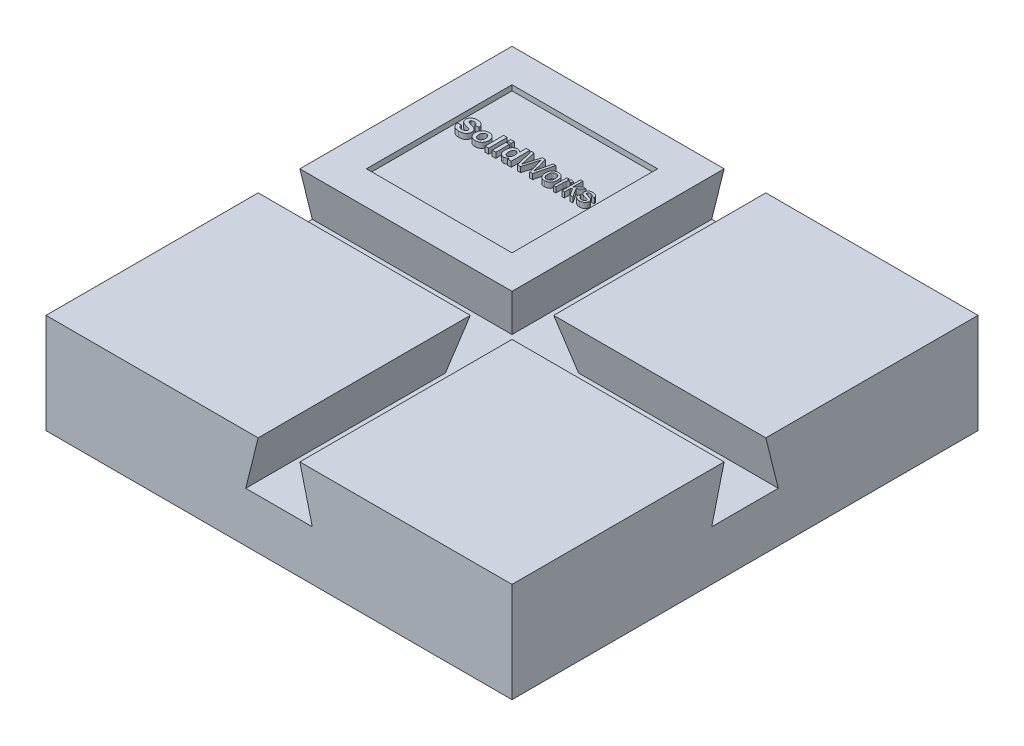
from build123d import *

# Parameters (mm, degrees)
SKETCH1_W           = 88.9
SKETCH1_H           = 88.9
BASE_EXTRUDE_DEPTH  = 19.05
CUT_EXTRUDE1_DEPTH  = 102.202346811
CUT_EXTRUDE2_DEPTH  = 103.21917076
SKETCH4_W           = 27.774849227
SKETCH4_H           = 27.774849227
CUT_EXTRUDE3_DEPTH  = 1.016
SKETCH5_W           = 0.679850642
SKETCH5_H           = 3.535223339
SKETCH5_H_2         = 0.58920389
SKETCH5_H_3         = 2.58343244
BOSS_EXTRUDE1_DEPTH = 1.016
BOSS_EXTRUDE2_DEPTH = 1.016


with BuildPart() as part:
    # Sketch1 → Base-Extrude (new body)
    with BuildSketch(Plane(origin=(0, 0, 0), x_dir=(1, 0, 0), z_dir=(0, 1, 0))):
        Rectangle(SKETCH1_W, SKETCH1_H)
    extrude(amount=BASE_EXTRUDE_DEPTH)

    # Sketch2 → Cut-Extrude1 (cut, through all)
    with BuildSketch(Plane.XY.offset(44.45)):
        Polygon((6.35, 9.525), (-6.35, 9.525), (-3.975150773, 19.05), (3.975150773, 19.05), align=None)
    extrude(amount=-CUT_EXTRUDE1_DEPTH, mode=Mode.SUBTRACT)

    # Sketch3 → Cut-Extrude2 (cut, through all)
    with BuildSketch(Plane(origin=(44.45, -3.538159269, -0.664564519), x_dir=(0, 0, -1), z_dir=(1, 0, 0))):
        Polygon((5.685435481, 13.063159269), (-7.014564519, 13.063159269), (-4.639715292, 22.588159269), (3.310586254, 22.588159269), align=None)
    extrude(amount=-CUT_EXTRUDE2_DEPTH, mode=Mode.SUBTRACT)

    # Sketch4 → Cut-Extrude3 (cut)
    with BuildSketch(Plane(origin=(0, 19.05, 0), x_dir=(-1, 0, 0), z_dir=(0, 1, 0))):
        with Locations((24.212575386, -24.212575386)):
            Rectangle(SKETCH4_W, SKETCH4_H)
    extrude(amount=-CUT_EXTRUDE3_DEPTH, mode=Mode.SUBTRACT)

    # Sketch5 → Boss-Extrude1 (add)
    # profile 1 of 6: a face of its own
    with BuildSketch(Plane(origin=(20.693749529, 18.034, -39.225659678), x_dir=(1, 0, 0), z_dir=(0, 1, 0))):
        with BuildLine():
            Line((-57.661495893, -12.647251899), (-56.981645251, -12.601928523))
            add(Edge.make_bspline(
                [(-56.981645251, -12.601928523), (-56.976229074, -12.630371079), (-56.965708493, -12.685618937), (-56.942333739, -12.764354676), (-56.916604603, -12.837758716), (-56.885856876, -12.905043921), (-56.852195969, -12.967454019), (-56.812856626, -13.023211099), (-56.770583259, -13.074095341), (-56.723283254, -13.1182792), (-56.671750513, -13.156976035), (-56.615727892, -13.189977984), (-56.555822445, -13.218541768), (-56.491887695, -13.242063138), (-56.423264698, -13.259621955), (-56.350551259, -13.272114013), (-56.273643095, -13.280113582), (-56.22108249, -13.281214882), (-56.194151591, -13.281779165)],
                knots=[0, 0, 0, 0, 1.204560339, 2.339781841, 3.415289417, 4.440034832, 5.416475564, 6.362424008, 7.275913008, 8.16578645, 9.05021719, 9.95355393, 10.867835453, 11.809845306, 12.784702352, 13.812224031, 14.87903166, 16, 16, 16, 16], degree=3))
            add(Edge.make_bspline(
                [(-56.194151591, -13.281779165), (-56.165805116, -13.281469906), (-56.110669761, -13.280868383), (-56.030772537, -13.273405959), (-55.956065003, -13.262715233), (-55.887206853, -13.245792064), (-55.822912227, -13.226866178), (-55.764777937, -13.20097355), (-55.71186323, -13.171110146), (-55.664304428, -13.13722292), (-55.622799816, -13.099639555), (-55.586489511, -13.060403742), (-55.554865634, -13.020363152), (-55.529975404, -12.977740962), (-55.509832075, -12.934260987), (-55.496518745, -12.888626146), (-55.487524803, -12.841884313), (-55.48649346, -12.809939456), (-55.485973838, -12.793844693)],
                knots=[0, 0, 0, 0, 1.417779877, 2.757654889, 4.012140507, 5.189587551, 6.302846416, 7.360586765, 8.365575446, 9.33904572, 10.275781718, 11.161696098, 12.012180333, 12.822428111, 13.625933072, 14.403138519, 15.195454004, 16, 16, 16, 16], degree=3))
            add(Edge.make_bspline(
                [(-55.485973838, -12.793844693), (-55.48661111, -12.773679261), (-55.487857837, -12.734228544), (-55.502867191, -12.677829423), (-55.525376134, -12.625577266), (-55.559266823, -12.578243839), (-55.604824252, -12.534987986), (-55.662937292, -12.494523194), (-55.735228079, -12.458120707), (-55.788858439, -12.437815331), (-55.817401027, -12.427008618)],
                knots=[0, 0, 0, 0, 0.90494901, 1.770400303, 2.607161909, 3.452839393, 4.36912122, 5.420987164, 6.627424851, 8, 8, 8, 8], degree=3))
            add(Edge.make_bspline(
                [(-55.817401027, -12.427008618), (-55.829647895, -12.422904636), (-55.857054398, -12.41372059), (-55.903806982, -12.400588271), (-55.960121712, -12.384189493), (-56.02681237, -12.365549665), (-56.103856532, -12.346486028), (-56.190393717, -12.323001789), (-56.287478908, -12.299633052), (-56.355399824, -12.282382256), (-56.391025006, -12.273334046)],
                knots=[0, 0, 0, 0, 0.521821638, 1.167752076, 1.961721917, 2.891982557, 3.96540661, 5.168436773, 6.514817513, 8, 8, 8, 8], degree=3))
            add(Edge.make_bspline(
                [(-56.391025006, -12.273334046), (-56.437419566, -12.261750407), (-56.526930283, -12.239401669), (-56.654593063, -12.19964485), (-56.772172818, -12.160144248), (-56.878537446, -12.117283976), (-56.974860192, -12.073968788), (-57.059583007, -12.027157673), (-57.134473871, -11.979281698), (-57.178114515, -11.943498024), (-57.199055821, -11.926326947)],
                knots=[0, 0, 0, 0, 1.293880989, 2.496331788, 3.617634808, 4.64976062, 5.598842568, 6.473791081, 7.267636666, 8, 8, 8, 8], degree=3))
            add(Edge.make_bspline(
                [(-57.199055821, -11.926326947), (-57.225025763, -11.902011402), (-57.275942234, -11.854338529), (-57.342965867, -11.776002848), (-57.399283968, -11.693253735), (-57.445639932, -11.606701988), (-57.481333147, -11.515849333), (-57.506632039, -11.4213039), (-57.5230064, -11.322818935), (-57.524677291, -11.25574834), (-57.525525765, -11.221690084)],
                knots=[0, 0, 0, 0, 1.064429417, 2.086912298, 3.078678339, 4.055528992, 5.020032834, 5.993708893, 6.981211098, 8, 8, 8, 8], degree=3))
            add(Edge.make_bspline(
                [(-57.525525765, -11.221690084), (-57.523873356, -11.177619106), (-57.520595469, -11.090195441), (-57.490535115, -10.961694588), (-57.443709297, -10.837701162), (-57.389402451, -10.73924579), (-57.337225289, -10.664763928), (-57.293895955, -10.611316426), (-57.246294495, -10.561294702), (-57.19376887, -10.515918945), (-57.138269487, -10.472531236), (-57.077646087, -10.434002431), (-57.013617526, -10.397710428), (-56.920960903, -10.354687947), (-56.795158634, -10.309854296), (-56.631483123, -10.272062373), (-56.453272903, -10.249344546), (-56.329719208, -10.246557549), (-56.265677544, -10.245112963)],
                knots=[0, 0, 0, 0, 1.180131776, 2.341029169, 3.518901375, 4.725685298, 5.343762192, 5.955650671, 6.568945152, 7.192346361, 7.815201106, 8.455999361, 9.116257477, 9.787318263, 11.192748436, 12.688084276, 14.283332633, 16, 16, 16, 16], degree=3))
            add(Edge.make_bspline(
                [(-56.265677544, -10.245112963), (-56.213240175, -10.245814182), (-56.111250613, -10.247178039), (-55.963404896, -10.260969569), (-55.825308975, -10.282434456), (-55.697447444, -10.3132472), (-55.57976073, -10.353958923), (-55.471792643, -10.402454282), (-55.37363493, -10.460030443), (-55.286482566, -10.527017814), (-55.208838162, -10.600867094), (-55.141105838, -10.681531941), (-55.083026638, -10.767993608), (-55.034225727, -10.860188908), (-54.9959025, -10.958591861), (-54.967755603, -11.063079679), (-54.949139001, -11.173406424), (-54.944472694, -11.249003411), (-54.942093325, -11.287550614)],
                knots=[0, 0, 0, 0, 1.325124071, 2.577337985, 3.749592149, 4.855247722, 5.896868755, 6.892903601, 7.842551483, 8.766257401, 9.665194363, 10.546067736, 11.423174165, 12.293291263, 13.177512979, 14.086532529, 15.024315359, 16, 16, 16, 16], degree=3))
            Line((-54.942093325, -11.287550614), (-55.621943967, -11.332873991))
            add(Edge.make_bspline(
                [(-55.621943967, -11.332873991), (-55.625865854, -11.311555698), (-55.633509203, -11.270008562), (-55.650127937, -11.210504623), (-55.668873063, -11.155470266), (-55.690813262, -11.104905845), (-55.717314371, -11.059717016), (-55.746155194, -11.018482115), (-55.778131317, -10.981750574), (-55.814301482, -10.95052822), (-55.853422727, -10.922117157), (-55.898007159, -10.899345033), (-55.946186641, -10.878217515), (-55.99979411, -10.862334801), (-56.057800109, -10.849736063), (-56.120238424, -10.840396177), (-56.187238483, -10.835835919), (-56.233332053, -10.8348348), (-56.257179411, -10.834316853)],
                knots=[0, 0, 0, 0, 1.151066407, 2.24330871, 3.278475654, 4.238599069, 5.165719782, 6.056502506, 6.909492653, 7.744782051, 8.590364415, 9.471203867, 10.39832458, 11.382154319, 12.435022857, 13.550631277, 14.73277401, 16, 16, 16, 16], degree=3))
            add(Edge.make_bspline(
                [(-56.257179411, -10.834316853), (-56.28197415, -10.834774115), (-56.330213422, -10.835663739), (-56.400510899, -10.84112323), (-56.466455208, -10.851200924), (-56.528370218, -10.864319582), (-56.586173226, -10.882166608), (-56.639742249, -10.903928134), (-56.689322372, -10.929548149), (-56.719554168, -10.949705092), (-56.734491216, -10.959664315)],
                knots=[0, 0, 0, 0, 1.186678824, 2.308736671, 3.37120409, 4.377216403, 5.334874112, 6.262130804, 7.141346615, 8, 8, 8, 8], degree=3))
            add(Edge.make_bspline(
                [(-56.734491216, -10.959664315), (-56.751585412, -10.973268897), (-56.784691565, -10.99961675), (-56.820320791, -11.051934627), (-56.841769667, -11.1110261), (-56.844351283, -11.152813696), (-56.845675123, -11.174242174)],
                knots=[0, 0, 0, 0, 1.037857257, 2.010007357, 2.979541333, 4, 4, 4, 4], degree=3))
            add(Edge.make_bspline(
                [(-56.845675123, -11.174242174), (-56.844592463, -11.19426851), (-56.842459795, -11.233717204), (-56.820949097, -11.289754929), (-56.787868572, -11.341677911), (-56.756960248, -11.369883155), (-56.740864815, -11.384570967)],
                knots=[0, 0, 0, 0, 0.98538058, 1.941042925, 2.927803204, 4, 4, 4, 4], degree=3))
            add(Edge.make_bspline(
                [(-56.740864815, -11.384570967), (-56.728091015, -11.394104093), (-56.699546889, -11.415406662), (-56.647259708, -11.442484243), (-56.584147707, -11.471810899), (-56.508772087, -11.500480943), (-56.421633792, -11.529097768), (-56.322727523, -11.558977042), (-56.211992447, -11.589257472), (-56.092251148, -11.618582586), (-55.970680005, -11.647407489), (-55.854668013, -11.678921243), (-55.746793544, -11.709644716), (-55.64755678, -11.741847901), (-55.556446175, -11.773197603), (-55.473904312, -11.805396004), (-55.399364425, -11.836753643), (-55.312442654, -11.879872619), (-55.213925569, -11.938279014), (-55.110668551, -12.023182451), (-55.019350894, -12.118619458), (-54.955723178, -12.208609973), (-54.912014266, -12.28600421), (-54.883870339, -12.347696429), (-54.859523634, -12.412704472), (-54.839705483, -12.481100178), (-54.825342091, -12.552979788), (-54.813455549, -12.627794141), (-54.807382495, -12.706164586), (-54.80654748, -12.759607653), (-54.806123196, -12.786762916)],
                knots=[0, 0, 0, 0, 0.511875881, 1.143829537, 1.88775736, 2.750598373, 3.734912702, 4.837306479, 6.073130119, 7.42648979, 8.801963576, 10.091065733, 11.292408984, 12.408830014, 13.446061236, 14.39066453, 15.257936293, 16.045629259, 17.510392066, 18.929669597, 20.331293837, 21.746891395, 22.460690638, 23.187651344, 23.925159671, 24.69163991, 25.474819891, 26.281170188, 27.126635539, 28, 28, 28, 28], degree=3))
            add(Edge.make_bspline(
                [(-54.806123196, -12.786762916), (-54.8067066, -12.811806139), (-54.807865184, -12.861539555), (-54.815961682, -12.9353565), (-54.828482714, -13.007862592), (-54.847018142, -13.079148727), (-54.871607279, -13.14907467), (-54.899292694, -13.218649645), (-54.933911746, -13.286356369), (-54.973312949, -13.35225092), (-55.016774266, -13.416283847), (-55.066024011, -13.475352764), (-55.118169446, -13.531428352), (-55.176542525, -13.581370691), (-55.237538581, -13.62922364), (-55.303947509, -13.671603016), (-55.374213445, -13.709952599), (-55.448780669, -13.74398607), (-55.527913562, -13.773643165), (-55.611509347, -13.800040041), (-55.700321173, -13.821643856), (-55.793608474, -13.840161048), (-55.891712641, -13.854242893), (-55.994511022, -13.864075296), (-56.102026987, -13.869620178), (-56.175260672, -13.870523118), (-56.212564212, -13.870983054)],
                knots=[0, 0, 0, 0, 0.900570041, 1.788444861, 2.667795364, 3.545012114, 4.433698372, 5.332345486, 6.235991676, 7.164928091, 8.092777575, 9.015680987, 9.928493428, 10.842962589, 11.775229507, 12.714851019, 13.672254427, 14.652424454, 15.660007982, 16.709910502, 17.803296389, 18.945495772, 20.129342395, 21.366102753, 22.658353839, 24, 24, 24, 24], degree=3))
            add(Edge.make_bspline(
                [(-56.212564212, -13.870983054), (-56.266424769, -13.870103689), (-56.371292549, -13.868391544), (-56.5236466, -13.853066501), (-56.666544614, -13.829610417), (-56.799753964, -13.795567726), (-56.923437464, -13.751864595), (-57.037538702, -13.698031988), (-57.141505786, -13.633748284), (-57.236626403, -13.56057247), (-57.321633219, -13.477171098), (-57.398071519, -13.385272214), (-57.464910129, -13.284048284), (-57.522105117, -13.173657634), (-57.57110247, -13.054697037), (-57.611511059, -12.927111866), (-57.641936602, -12.79029361), (-57.65486337, -12.695757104), (-57.661495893, -12.647251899)],
                knots=[0, 0, 0, 0, 1.217954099, 2.371385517, 3.459848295, 4.490682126, 5.476952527, 6.422732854, 7.338496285, 8.236688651, 9.131557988, 10.026443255, 10.935708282, 11.869506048, 12.834296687, 13.842423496, 14.892981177, 16, 16, 16, 16], degree=3))
        make_face()
    # profile 2 of 6: a face of its own
    with BuildSketch(Plane(origin=(20.693749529, 18.034, -39.225659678), x_dir=(1, 0, 0), z_dir=(0, 1, 0))):
        with BuildLine():
            add(Edge.make_bspline(
                [(-54.398212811, -12.497826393), (-54.396031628, -12.441991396), (-54.391665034, -12.330213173), (-54.360475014, -12.164172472), (-54.307681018, -12.001464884), (-54.248586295, -11.869450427), (-54.190236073, -11.768526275), (-54.143114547, -11.695749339), (-54.090508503, -11.628439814), (-54.033494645, -11.566171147), (-53.973355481, -11.50745056), (-53.907973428, -11.454438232), (-53.838194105, -11.406220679), (-53.764698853, -11.362265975), (-53.687592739, -11.323672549), (-53.608307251, -11.289366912), (-53.52652199, -11.261179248), (-53.442806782, -11.237803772), (-53.35679862, -11.219055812), (-53.268473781, -11.206781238), (-53.17793923, -11.198596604), (-53.116901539, -11.197473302), (-53.085959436, -11.196903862)],
                knots=[0, 0, 0, 0, 1.619840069, 3.242819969, 4.882696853, 6.574901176, 7.427927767, 8.263869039, 9.088735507, 9.903385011, 10.712399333, 11.525463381, 12.34252837, 13.171904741, 14.008210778, 14.842888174, 15.67691885, 16.516221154, 17.363978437, 18.229048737, 19.10224397, 20, 20, 20, 20], degree=3))
            add(Edge.make_bspline(
                [(-53.085959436, -11.196903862), (-53.038927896, -11.197909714), (-52.946407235, -11.199888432), (-52.810962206, -11.217912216), (-52.682198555, -11.247606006), (-52.559942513, -11.288951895), (-52.444101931, -11.341954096), (-52.335259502, -11.407835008), (-52.232515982, -11.484661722), (-52.137815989, -11.572902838), (-52.051255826, -11.669521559), (-51.976182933, -11.773975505), (-51.912107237, -11.884244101), (-51.859038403, -12.000502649), (-51.81875588, -12.123364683), (-51.790926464, -12.252529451), (-51.772291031, -12.387517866), (-51.77041372, -12.479821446), (-51.769456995, -12.526861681)],
                knots=[0, 0, 0, 0, 1.076054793, 2.116819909, 3.120736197, 4.09633837, 5.065772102, 6.030360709, 7.002891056, 7.996945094, 8.988102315, 9.967288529, 10.93568283, 11.902870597, 12.887008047, 13.888537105, 14.923945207, 16, 16, 16, 16], degree=3))
            add(Edge.make_bspline(
                [(-51.769456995, -12.526861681), (-51.77041753, -12.574371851), (-51.772297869, -12.667377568), (-51.790822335, -12.803619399), (-51.819466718, -12.933925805), (-51.860571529, -13.058032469), (-51.913526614, -13.175797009), (-51.977323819, -13.28762167), (-52.053653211, -13.392918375), (-52.141051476, -13.490589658), (-52.236974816, -13.579313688), (-52.338980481, -13.658187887), (-52.448299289, -13.723212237), (-52.563013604, -13.777890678), (-52.684303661, -13.819385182), (-52.811478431, -13.848982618), (-52.944440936, -13.86828577), (-53.035374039, -13.870072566), (-53.08171037, -13.870983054)],
                knots=[0, 0, 0, 0, 1.084306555, 2.122634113, 3.133511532, 4.127271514, 5.10202058, 6.077484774, 7.061903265, 8.065960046, 9.065303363, 10.042062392, 11.004391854, 11.964060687, 12.939122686, 13.924942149, 14.942623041, 16, 16, 16, 16], degree=3))
            add(Edge.make_bspline(
                [(-53.08171037, -13.870983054), (-53.139435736, -13.869092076), (-53.254475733, -13.865323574), (-53.424710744, -13.834412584), (-53.590740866, -13.784539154), (-53.724502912, -13.727133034), (-53.826682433, -13.671154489), (-53.899145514, -13.624033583), (-53.967484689, -13.573464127), (-54.030100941, -13.516845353), (-54.088074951, -13.45580305), (-54.142174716, -13.390928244), (-54.190473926, -13.320723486), (-54.234321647, -13.246464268), (-54.273666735, -13.167619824), (-54.306466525, -13.083973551), (-54.334963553, -12.996507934), (-54.358466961, -12.905024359), (-54.375894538, -12.809130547), (-54.388566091, -12.709133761), (-54.396506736, -12.604888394), (-54.397637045, -12.533957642), (-54.398212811, -12.497826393)],
                knots=[0, 0, 0, 0, 1.610846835, 3.210231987, 4.81374032, 6.443368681, 7.263437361, 8.06418174, 8.855100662, 9.634539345, 10.417731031, 11.204243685, 11.990424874, 12.794120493, 13.610605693, 14.447765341, 15.300248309, 16.177865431, 17.082777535, 18.019649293, 18.991233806, 20, 20, 20, 20], degree=3))
        make_face()
        with BuildLine():
            add(Edge.make_bspline(
                [(-53.718362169, -12.533943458), (-53.71785831, -12.566777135), (-53.7168778, -12.630671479), (-53.708138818, -12.723633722), (-53.694593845, -12.810930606), (-53.673676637, -12.891750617), (-53.648452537, -12.967185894), (-53.61643329, -13.036233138), (-53.579845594, -13.100200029), (-53.536302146, -13.15669376), (-53.488844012, -13.206702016), (-53.43910328, -13.251137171), (-53.386592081, -13.288973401), (-53.330987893, -13.31973522), (-53.272359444, -13.343088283), (-53.211398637, -13.360224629), (-53.147667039, -13.370291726), (-53.104407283, -13.371706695), (-53.082418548, -13.372425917)],
                knots=[0, 0, 0, 0, 1.334287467, 2.596523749, 3.792235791, 4.920928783, 5.98599801, 7.020725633, 8.009778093, 8.975087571, 9.91178927, 10.809031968, 11.682407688, 12.537028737, 13.385161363, 14.241880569, 15.106355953, 16, 16, 16, 16], degree=3))
            add(Edge.make_bspline(
                [(-53.082418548, -13.372425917), (-53.060428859, -13.371709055), (-53.017167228, -13.370298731), (-52.953449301, -13.360197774), (-52.892648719, -13.343246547), (-52.834399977, -13.319544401), (-52.778939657, -13.289001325), (-52.726461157, -13.251111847), (-52.676756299, -13.206885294), (-52.629684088, -13.156607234), (-52.587400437, -13.09934426), (-52.550454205, -13.035577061), (-52.518435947, -12.96626551), (-52.4930953, -12.890430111), (-52.47332447, -12.80867998), (-52.459459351, -12.720816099), (-52.45079091, -12.626889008), (-52.449812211, -12.562290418), (-52.449307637, -12.528986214)],
                knots=[0, 0, 0, 0, 0.891374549, 1.753654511, 2.608197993, 3.445305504, 4.297756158, 5.168913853, 6.063877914, 6.991658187, 7.956416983, 8.942957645, 9.975057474, 11.046479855, 12.179282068, 13.381405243, 14.649967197, 16, 16, 16, 16], degree=3))
            add(Edge.make_bspline(
                [(-52.449307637, -12.528986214), (-52.449814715, -12.496390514), (-52.450797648, -12.433206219), (-52.459417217, -12.341386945), (-52.473513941, -12.255223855), (-52.492943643, -12.174803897), (-52.518567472, -12.099989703), (-52.550654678, -12.031473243), (-52.587157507, -11.967891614), (-52.629931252, -11.911227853), (-52.676726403, -11.860979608), (-52.726468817, -11.816780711), (-52.778937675, -11.778884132), (-52.834400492, -11.748342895), (-52.892648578, -11.724640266), (-52.953449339, -11.70768917), (-53.017167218, -11.697588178), (-53.060428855, -11.696177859), (-53.082418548, -11.695461)],
                knots=[0, 0, 0, 0, 1.332105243, 2.582185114, 3.76554119, 4.898206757, 5.96011018, 6.991864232, 7.986448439, 8.951336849, 9.886681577, 10.788942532, 11.667203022, 12.526603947, 13.370536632, 14.232047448, 15.101357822, 16, 16, 16, 16], degree=3))
            add(Edge.make_bspline(
                [(-53.082418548, -11.695461), (-53.104407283, -11.696180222), (-53.147667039, -11.69759519), (-53.211398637, -11.707662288), (-53.272359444, -11.724798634), (-53.330987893, -11.748151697), (-53.386592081, -11.778913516), (-53.43910328, -11.816749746), (-53.488844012, -11.861184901), (-53.536302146, -11.911193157), (-53.579845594, -11.967686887), (-53.61643329, -12.031653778), (-53.648452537, -12.100701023), (-53.673676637, -12.176136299), (-53.694593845, -12.256956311), (-53.708138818, -12.344253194), (-53.7168778, -12.437215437), (-53.71785831, -12.501109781), (-53.718362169, -12.533943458)],
                knots=[0, 0, 0, 0, 0.893644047, 1.758119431, 2.614838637, 3.462971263, 4.317592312, 5.190968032, 6.08821073, 7.024912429, 7.990221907, 8.979274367, 10.01400199, 11.079071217, 12.207764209, 13.403476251, 14.665712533, 16, 16, 16, 16], degree=3))
        make_face(mode=Mode.SUBTRACT)
    # profile 3 of 6: a face of its own
    with BuildSketch(Plane(origin=(20.693749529, 18.034, -39.225659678), x_dir=(1, 0, 0), z_dir=(0, 1, 0))):
        with Locations((-50.88565116, -12.058048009)):
            Rectangle(SKETCH5_W, SKETCH5_H)
    # profile 4 of 6: a face of its own
    with BuildSketch(Plane(origin=(20.693749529, 18.034, -39.225659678), x_dir=(1, 0, 0), z_dir=(0, 1, 0))):
        with Locations((-49.525949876, -10.585038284)):
            Rectangle(SKETCH5_W, SKETCH5_H_2)
    # profile 5 of 6: a face of its own
    with BuildSketch(Plane(origin=(20.693749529, 18.034, -39.225659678), x_dir=(1, 0, 0), z_dir=(0, 1, 0))):
        with Locations((-49.525949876, -12.533943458)):
            Rectangle(SKETCH5_W, SKETCH5_H_3)
    # profile 6 of 6: a face of its own
    with BuildSketch(Plane(origin=(20.693749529, 18.034, -39.225659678), x_dir=(1, 0, 0), z_dir=(0, 1, 0))):
        with BuildLine():
            Line((-46.240005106, -13.825659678), (-46.919855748, -13.825659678))
            Line((-46.919855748, -13.825659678), (-46.919855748, -13.452450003))
            add(Edge.make_bspline(
                [(-46.919855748, -13.452450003), (-46.944670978, -13.487199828), (-46.992903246, -13.554741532), (-47.078937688, -13.641295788), (-47.169284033, -13.715839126), (-47.267751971, -13.772408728), (-47.368357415, -13.8165179), (-47.470262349, -13.84796296), (-47.57302064, -13.867094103), (-47.641882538, -13.869689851), (-47.676189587, -13.870983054)],
                knots=[0, 0, 0, 0, 1.136300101, 2.208576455, 3.242281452, 4.249058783, 5.223933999, 6.165280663, 7.085941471, 8, 8, 8, 8], degree=3))
            add(Edge.make_bspline(
                [(-47.676189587, -13.870983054), (-47.710239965, -13.869840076), (-47.777554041, -13.867580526), (-47.876873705, -13.851185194), (-47.972198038, -13.822350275), (-48.063986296, -13.783359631), (-48.151901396, -13.733219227), (-48.235853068, -13.671791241), (-48.316008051, -13.598928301), (-48.392283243, -13.5159782), (-48.46143267, -13.422389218), (-48.522764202, -13.320210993), (-48.573798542, -13.208694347), (-48.615431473, -13.088643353), (-48.647938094, -12.959731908), (-48.671190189, -12.822172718), (-48.684412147, -12.67583822), (-48.686431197, -12.57551633), (-48.687467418, -12.52402897)],
                knots=[0, 0, 0, 0, 0.868680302, 1.717291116, 2.559594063, 3.404262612, 4.256691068, 5.136162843, 6.05305749, 7.01654586, 8.006773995, 9.017023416, 10.051895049, 11.130067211, 12.254925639, 13.440213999, 14.686262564, 16, 16, 16, 16], degree=3))
            add(Edge.make_bspline(
                [(-48.687467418, -12.52402897), (-48.686437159, -12.471361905), (-48.684437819, -12.369155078), (-48.671285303, -12.220687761), (-48.648006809, -12.082175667), (-48.615518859, -11.9532515), (-48.573961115, -11.833837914), (-48.522901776, -11.724098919), (-48.462602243, -11.624136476), (-48.392793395, -11.53488573), (-48.316367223, -11.455357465), (-48.234003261, -11.386527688), (-48.146872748, -11.327954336), (-48.055308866, -11.279230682), (-47.958145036, -11.242290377), (-47.856405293, -11.21651079), (-47.749959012, -11.199167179), (-47.677204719, -11.197668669), (-47.640072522, -11.196903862)],
                knots=[0, 0, 0, 0, 1.327136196, 2.575468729, 3.751890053, 4.862767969, 5.921925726, 6.933145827, 7.907387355, 8.856890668, 9.782390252, 10.681851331, 11.556239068, 12.423659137, 13.289752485, 14.16837887, 15.06518071, 16, 16, 16, 16], degree=3))
            add(Edge.make_bspline(
                [(-47.640072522, -11.196903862), (-47.605776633, -11.198007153), (-47.538207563, -11.200180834), (-47.43862115, -11.217056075), (-47.34268001, -11.244414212), (-47.250604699, -11.284247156), (-47.16151207, -11.333844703), (-47.076545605, -11.395235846), (-46.994890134, -11.467347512), (-46.945304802, -11.522155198), (-46.919855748, -11.550284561)],
                knots=[0, 0, 0, 0, 0.992399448, 1.955205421, 2.915485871, 3.87381908, 4.85285833, 5.861755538, 6.90257267, 8, 8, 8, 8], degree=3))
            Line((-46.919855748, -11.550284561), (-46.919855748, -10.290436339))
            Line((-46.919855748, -10.290436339), (-46.240005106, -10.290436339))
            Line((-46.240005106, -10.290436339), (-46.240005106, -13.825659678))
        make_face()
        with BuildLine():
            add(Edge.make_bspline(
                [(-48.007616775, -12.485079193), (-48.007515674, -12.519320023), (-48.007320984, -12.585257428), (-48.001070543, -12.680413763), (-47.993227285, -12.768170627), (-47.980841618, -12.84844104), (-47.966722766, -12.921823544), (-47.947296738, -12.987425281), (-47.925997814, -13.046397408), (-47.907440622, -13.081539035), (-47.898557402, -13.098361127)],
                knots=[0, 0, 0, 0, 1.306099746, 2.515150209, 3.637201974, 4.666415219, 5.613193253, 6.485405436, 7.274972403, 8, 8, 8, 8], degree=3))
            add(Edge.make_bspline(
                [(-47.898557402, -13.098361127), (-47.885429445, -13.120236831), (-47.860027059, -13.162565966), (-47.813679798, -13.217922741), (-47.7651873, -13.266341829), (-47.71102131, -13.304768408), (-47.653676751, -13.335773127), (-47.591905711, -13.356880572), (-47.526626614, -13.370173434), (-47.481743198, -13.371663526), (-47.458779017, -13.372425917)],
                knots=[0, 0, 0, 0, 1.120960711, 2.169040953, 3.168100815, 4.128109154, 5.080726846, 6.026866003, 6.990464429, 8, 8, 8, 8], degree=3))
            add(Edge.make_bspline(
                [(-47.458779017, -13.372425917), (-47.440336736, -13.371627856), (-47.403933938, -13.370052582), (-47.350435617, -13.361086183), (-47.299431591, -13.344239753), (-47.250623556, -13.321426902), (-47.203175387, -13.293022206), (-47.158606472, -13.257134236), (-47.116005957, -13.215062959), (-47.07559482, -13.166937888), (-47.038623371, -13.112352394), (-47.006746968, -13.05098843), (-46.979953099, -12.983007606), (-46.957390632, -12.909189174), (-46.940406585, -12.828829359), (-46.928921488, -12.742405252), (-46.920558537, -12.649538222), (-46.92009489, -12.58542482), (-46.919855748, -12.55235608)],
                knots=[0, 0, 0, 0, 0.808519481, 1.595918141, 2.367946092, 3.154732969, 3.953063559, 4.785064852, 5.655532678, 6.573390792, 7.534530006, 8.538576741, 9.596996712, 10.732480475, 11.917354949, 13.191565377, 14.551451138, 16, 16, 16, 16], degree=3))
            add(Edge.make_bspline(
                [(-46.919855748, -12.55235608), (-46.920178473, -12.515754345), (-46.920801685, -12.445072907), (-46.927947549, -12.342938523), (-46.939675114, -12.248525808), (-46.956634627, -12.16219442), (-46.97756706, -12.083630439), (-47.003741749, -12.013130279), (-47.034561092, -11.950338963), (-47.07113488, -11.896033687), (-47.11134803, -11.849337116), (-47.152708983, -11.807557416), (-47.198133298, -11.773442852), (-47.245638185, -11.744737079), (-47.296359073, -11.72256167), (-47.349982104, -11.707279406), (-47.405955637, -11.696652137), (-47.444328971, -11.695861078), (-47.463736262, -11.695461)],
                knots=[0, 0, 0, 0, 1.538844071, 2.971654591, 4.302575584, 5.536777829, 6.668535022, 7.717613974, 8.694219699, 9.60272161, 10.461894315, 11.283130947, 12.06930595, 12.843865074, 13.612870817, 14.388700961, 15.185086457, 16, 16, 16, 16], degree=3))
            add(Edge.make_bspline(
                [(-47.463736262, -11.695461), (-47.482658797, -11.695941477), (-47.520028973, -11.696890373), (-47.574755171, -11.70633828), (-47.627099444, -11.721997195), (-47.676826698, -11.74430195), (-47.724729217, -11.772048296), (-47.770216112, -11.806182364), (-47.81287633, -11.847123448), (-47.853017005, -11.893756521), (-47.890437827, -11.946032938), (-47.921055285, -12.005585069), (-47.948370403, -12.070296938), (-47.970078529, -12.141524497), (-47.986967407, -12.218748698), (-47.998578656, -12.302099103), (-48.006914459, -12.391431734), (-48.00737762, -12.453190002), (-48.007616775, -12.485079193)],
                knots=[0, 0, 0, 0, 0.844531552, 1.667868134, 2.47173451, 3.278912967, 4.096287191, 4.939765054, 5.812329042, 6.731790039, 7.685377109, 8.6758465, 9.71559549, 10.819442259, 11.996209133, 13.242749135, 14.576279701, 16, 16, 16, 16], degree=3))
        make_face(mode=Mode.SUBTRACT)
    extrude(amount=BOSS_EXTRUDE1_DEPTH)

    # Sketch6 → Boss-Extrude2 (add)
    # profile 1 of 5: a face of its own
    with BuildSketch(Plane(origin=(42.628758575, 18.034, -41.340362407), x_dir=(1, 0, 0), z_dir=(0, 1, 0))):
        with BuildLine():
            Line((-66.985511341, -15.940362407), (-67.875690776, -12.405139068))
            Line((-67.875690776, -12.405139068), (-67.36084555, -12.405139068))
            Line((-67.36084555, -12.405139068), (-66.836085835, -14.730086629))
            add(Edge.make_bspline(
                [(-66.836085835, -14.730086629), (-66.808889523, -14.849993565), (-66.754774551, -15.088583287), (-66.70124751, -15.327305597), (-66.674621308, -15.446054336)],
                knots=[0, 0, 0, 0, 1.00513078, 2, 2, 2, 2], degree=3))
            add(Edge.make_bspline(
                [(-66.674621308, -15.446054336), (-66.662014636, -15.403355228), (-66.638215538, -15.322747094), (-66.606043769, -15.208477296), (-66.576823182, -15.108745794), (-66.551928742, -15.023087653), (-66.531771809, -14.951382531), (-66.514368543, -14.894511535), (-66.502506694, -14.851360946), (-66.495477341, -14.827571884), (-66.492619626, -14.81790067)],
                knots=[0, 0, 0, 0, 1.633809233, 3.084334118, 4.356383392, 5.447555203, 6.357852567, 7.089694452, 7.629924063, 8, 8, 8, 8], degree=3))
            Line((-66.492619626, -14.81790067), (-65.794356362, -12.405139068))
            Line((-65.794356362, -12.405139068), (-65.194529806, -12.405139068))
            Line((-65.194529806, -12.405139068), (-64.689599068, -14.176291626))
            add(Edge.make_bspline(
                [(-64.689599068, -14.176291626), (-64.661733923, -14.285706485), (-64.606789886, -14.501448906), (-64.533787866, -14.822805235), (-64.466409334, -15.136365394), (-64.427598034, -15.343751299), (-64.408452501, -15.446054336)],
                knots=[0, 0, 0, 0, 1.04154457, 2.053700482, 3.039894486, 4, 4, 4, 4], degree=3))
            add(Edge.make_bspline(
                [(-64.408452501, -15.446054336), (-64.396714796, -15.393634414), (-64.372013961, -15.283321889), (-64.331678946, -15.109605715), (-64.289933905, -14.91859591), (-64.259828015, -14.785775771), (-64.244155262, -14.716631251)],
                knots=[0, 0, 0, 0, 0.862130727, 1.814268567, 2.86213528, 4, 4, 4, 4], degree=3))
            Line((-64.244155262, -14.716631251), (-63.722228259, -12.405139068))
            Line((-63.722228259, -12.405139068), (-63.207383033, -12.405139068))
            Line((-63.207383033, -12.405139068), (-64.098270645, -15.940362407))
            Line((-64.098270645, -15.940362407), (-64.646400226, -15.940362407))
            Line((-64.646400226, -15.940362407), (-65.385029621, -13.238664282))
            add(Edge.make_bspline(
                [(-65.385029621, -13.238664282), (-65.392446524, -13.212252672), (-65.406535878, -13.162080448), (-65.425003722, -13.090482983), (-65.443317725, -13.027515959), (-65.457884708, -12.972365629), (-65.470491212, -12.925587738), (-65.481654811, -12.887319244), (-65.488834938, -12.85681117), (-65.494027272, -12.839471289), (-65.496213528, -12.832170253)],
                knots=[0, 0, 0, 0, 1.562239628, 2.967673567, 4.210417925, 5.296319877, 6.215971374, 6.969386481, 7.566055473, 8, 8, 8, 8], degree=3))
            add(Edge.make_bspline(
                [(-65.496213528, -12.832170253), (-65.509322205, -12.878469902), (-65.534091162, -12.965953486), (-65.570772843, -13.089112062), (-65.601552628, -13.197405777), (-65.621058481, -13.264403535), (-65.630059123, -13.295318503)],
                knots=[0, 0, 0, 0, 1.197730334, 2.263121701, 3.198547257, 4, 4, 4, 4], degree=3))
            Line((-65.630059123, -13.295318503), (-66.395599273, -15.940362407))
            Line((-66.395599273, -15.940362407), (-66.985511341, -15.940362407))
        make_face()
    # profile 2 of 5: a face of its own
    with BuildSketch(Plane(origin=(42.628758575, 18.034, -41.340362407), x_dir=(1, 0, 0), z_dir=(0, 1, 0))):
        with BuildLine():
            add(Edge.make_bspline(
                [(-62.980766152, -14.648646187), (-62.979497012, -14.591239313), (-62.977041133, -14.480152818), (-62.959454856, -14.318957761), (-62.929304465, -14.169305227), (-62.886992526, -14.031054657), (-62.832274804, -13.904162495), (-62.764677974, -13.789340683), (-62.686066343, -13.684479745), (-62.623329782, -13.625207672), (-62.591976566, -13.59558587)],
                knots=[0, 0, 0, 0, 1.189940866, 2.302622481, 3.356378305, 4.350088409, 5.294652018, 6.213657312, 7.107257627, 8, 8, 8, 8], degree=3))
            add(Edge.make_bspline(
                [(-62.591976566, -13.59558587), (-62.564554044, -13.572821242), (-62.510209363, -13.527707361), (-62.421508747, -13.470495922), (-62.329161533, -13.421341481), (-62.23235171, -13.380584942), (-62.130773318, -13.349445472), (-62.024742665, -13.32783329), (-61.914395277, -13.313713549), (-61.839228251, -13.31231761), (-61.800942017, -13.311606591)],
                knots=[0, 0, 0, 0, 0.994414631, 1.970684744, 2.940793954, 3.912782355, 4.898970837, 5.902128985, 6.931451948, 8, 8, 8, 8], degree=3))
            add(Edge.make_bspline(
                [(-61.800942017, -13.311606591), (-61.758649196, -13.312799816), (-61.675895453, -13.315134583), (-61.554458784, -13.330359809), (-61.439466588, -13.358653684), (-61.329438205, -13.395735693), (-61.226039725, -13.445153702), (-61.127638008, -13.5040701), (-61.036642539, -13.575472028), (-60.951309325, -13.656178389), (-60.874328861, -13.746434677), (-60.807260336, -13.845797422), (-60.750462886, -13.953408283), (-60.703545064, -14.069369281), (-60.667563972, -14.193761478), (-60.642484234, -14.326319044), (-60.626417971, -14.466720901), (-60.624786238, -14.563147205), (-60.623950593, -14.612529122)],
                knots=[0, 0, 0, 0, 1.026363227, 2.008269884, 2.962742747, 3.895658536, 4.820662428, 5.738204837, 6.673158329, 7.621267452, 8.584296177, 9.545483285, 10.524327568, 11.531652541, 12.575780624, 13.660990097, 14.802144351, 16, 16, 16, 16], degree=3))
            add(Edge.make_bspline(
                [(-60.623950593, -14.612529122), (-60.624265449, -14.652671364), (-60.624877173, -14.730662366), (-60.632271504, -14.844301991), (-60.643445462, -14.951349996), (-60.658653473, -15.05192821), (-60.679139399, -15.14587537), (-60.704685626, -15.233116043), (-60.734311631, -15.31412139), (-60.768361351, -15.388977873), (-60.807213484, -15.458290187), (-60.849539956, -15.523552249), (-60.896404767, -15.584665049), (-60.947747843, -15.641527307), (-61.002876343, -15.694551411), (-61.062166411, -15.743938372), (-61.125727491, -15.788977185), (-61.215463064, -15.843660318), (-61.333902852, -15.900962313), (-61.483912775, -15.950068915), (-61.640412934, -15.979999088), (-61.746989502, -15.983774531), (-61.800942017, -15.985685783)],
                knots=[0, 0, 0, 0, 1.174068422, 2.28105775, 3.329581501, 4.321819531, 5.255045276, 6.14001734, 6.978936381, 7.776151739, 8.542754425, 9.301196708, 10.049767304, 10.792968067, 11.540167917, 12.285482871, 13.048063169, 13.816653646, 15.357768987, 16.884132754, 18.422646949, 20, 20, 20, 20], degree=3))
            add(Edge.make_bspline(
                [(-61.800942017, -15.985685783), (-61.843950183, -15.984519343), (-61.928129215, -15.982236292), (-62.051283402, -15.966659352), (-62.168164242, -15.939968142), (-62.278419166, -15.901071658), (-62.383030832, -15.853324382), (-62.481010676, -15.793719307), (-62.572548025, -15.723555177), (-62.656834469, -15.642379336), (-62.733900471, -15.552000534), (-62.799686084, -15.450478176), (-62.855990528, -15.339906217), (-62.901991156, -15.219807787), (-62.93712922, -15.090179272), (-62.962362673, -14.95136193), (-62.978312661, -14.803164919), (-62.97993338, -14.701093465), (-62.980766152, -14.648646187)],
                knots=[0, 0, 0, 0, 1.022681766, 2.001674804, 2.94671416, 3.868132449, 4.777362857, 5.676573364, 6.589418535, 7.514523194, 8.454681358, 9.407574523, 10.384198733, 11.400667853, 12.460217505, 13.573389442, 14.753137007, 16, 16, 16, 16], degree=3))
        make_face()
        with BuildLine():
            add(Edge.make_bspline(
                [(-62.527532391, -14.647229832), (-62.526763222, -14.685015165), (-62.525275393, -14.75810453), (-62.516395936, -14.864191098), (-62.500174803, -14.962679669), (-62.477607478, -15.053928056), (-62.448662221, -15.1379492), (-62.413186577, -15.214885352), (-62.371567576, -15.284801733), (-62.322902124, -15.346558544), (-62.269937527, -15.40114471), (-62.212810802, -15.448229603), (-62.152316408, -15.488210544), (-62.088351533, -15.520809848), (-62.02120584, -15.546566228), (-61.950733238, -15.565111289), (-61.876808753, -15.575759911), (-61.826470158, -15.577097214), (-61.800942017, -15.577775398)],
                knots=[0, 0, 0, 0, 1.36128903, 2.633184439, 3.831299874, 4.953299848, 6.015607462, 7.027679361, 8.000438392, 8.93945591, 9.853536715, 10.73548639, 11.60109037, 12.460616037, 13.316600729, 14.187036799, 15.080594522, 16, 16, 16, 16], degree=3))
            add(Edge.make_bspline(
                [(-61.800942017, -15.577775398), (-61.775633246, -15.577197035), (-61.725696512, -15.576055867), (-61.652734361, -15.563974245), (-61.582514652, -15.546641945), (-61.51561755, -15.521067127), (-61.452599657, -15.487331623), (-61.392239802, -15.447426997), (-61.335761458, -15.399653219), (-61.282190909, -15.345171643), (-61.234220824, -15.282503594), (-61.191192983, -15.212864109), (-61.155840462, -15.134678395), (-61.127260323, -15.04914372), (-61.104443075, -14.956077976), (-61.088297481, -14.855445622), (-61.079469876, -14.747004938), (-61.077961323, -14.672267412), (-61.077184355, -14.633774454)],
                knots=[0, 0, 0, 0, 0.904535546, 1.784739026, 2.638791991, 3.488785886, 4.338695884, 5.191202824, 6.07237792, 6.980061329, 7.919174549, 8.889507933, 9.902165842, 10.981000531, 12.111539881, 13.326270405, 14.622917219, 16, 16, 16, 16], degree=3))
            add(Edge.make_bspline(
                [(-61.077184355, -14.633774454), (-61.077967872, -14.597406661), (-61.079491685, -14.526677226), (-61.088271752, -14.423867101), (-61.104701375, -14.328030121), (-61.126829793, -14.238896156), (-61.15716237, -14.157199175), (-61.192015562, -14.081390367), (-61.235043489, -14.012973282), (-61.283858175, -13.951562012), (-61.337137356, -13.896909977), (-61.393758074, -13.848947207), (-61.454310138, -13.80955857), (-61.517334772, -13.776071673), (-61.583852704, -13.751050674), (-61.653235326, -13.73212396), (-61.726017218, -13.72151066), (-61.77565072, -13.720189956), (-61.800942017, -13.719516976)],
                knots=[0, 0, 0, 0, 1.329905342, 2.586449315, 3.768451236, 4.882143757, 5.938857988, 6.950440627, 7.927559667, 8.885972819, 9.813736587, 10.714405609, 11.592966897, 12.450023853, 13.318821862, 14.185602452, 15.075453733, 16, 16, 16, 16], degree=3))
            add(Edge.make_bspline(
                [(-61.800942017, -13.719516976), (-61.826467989, -13.720200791), (-61.876802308, -13.721549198), (-61.950757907, -13.732117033), (-62.021035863, -13.750936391), (-62.08852371, -13.775569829), (-62.152252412, -13.808482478), (-62.213097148, -13.848243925), (-62.269438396, -13.89622083), (-62.323204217, -13.949962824), (-62.371311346, -14.011726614), (-62.413213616, -14.080940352), (-62.448803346, -14.157395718), (-62.477586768, -14.24124723), (-62.5001808, -14.332485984), (-62.51639457, -14.430977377), (-62.525254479, -14.536827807), (-62.526757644, -14.609680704), (-62.527532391, -14.647229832)],
                knots=[0, 0, 0, 0, 0.920966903, 1.816042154, 2.687956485, 3.542385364, 4.403370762, 5.270444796, 6.159337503, 7.068888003, 8.009500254, 8.976623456, 9.982690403, 11.046802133, 12.170707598, 13.370857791, 14.644913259, 16, 16, 16, 16], degree=3))
        make_face(mode=Mode.SUBTRACT)
    # profile 3 of 5: a face of its own
    with BuildSketch(Plane(origin=(42.628758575, 18.034, -41.340362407), x_dir=(1, 0, 0), z_dir=(0, 1, 0))):
        with BuildLine():
            Line((-60.125393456, -15.940362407), (-60.125393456, -13.356929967))
            Line((-60.125393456, -13.356929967), (-59.71748307, -13.356929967))
            Line((-59.71748307, -13.356929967), (-59.71748307, -13.717392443))
            add(Edge.make_bspline(
                [(-59.71748307, -13.717392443), (-59.694666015, -13.679266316), (-59.652394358, -13.608632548), (-59.585724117, -13.515555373), (-59.522288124, -13.44265659), (-59.458250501, -13.390713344), (-59.394166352, -13.354764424), (-59.328728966, -13.330015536), (-59.260266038, -13.314294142), (-59.213581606, -13.31251132), (-59.189890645, -13.311606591)],
                knots=[0, 0, 0, 0, 1.517336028, 2.811068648, 3.907416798, 4.807929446, 5.613162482, 6.406966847, 7.191583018, 8, 8, 8, 8], degree=3))
            add(Edge.make_bspline(
                [(-59.189890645, -13.311606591), (-59.154827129, -13.313171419), (-59.083757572, -13.316343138), (-58.977271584, -13.340684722), (-58.869525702, -13.377589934), (-58.800899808, -13.4140167), (-58.765692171, -13.432704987)],
                knots=[0, 0, 0, 0, 0.943117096, 1.911585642, 2.928565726, 4, 4, 4, 4], degree=3))
            Line((-58.765692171, -13.432704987), (-58.907327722, -13.825743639))
            add(Edge.make_bspline(
                [(-58.907327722, -13.825743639), (-58.931917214, -13.809394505), (-58.97934055, -13.777863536), (-59.055381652, -13.744468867), (-59.131361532, -13.723154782), (-59.18244041, -13.720717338), (-59.207595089, -13.719516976)],
                knots=[0, 0, 0, 0, 1.093324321, 2.108587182, 3.068540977, 4, 4, 4, 4], degree=3))
            add(Edge.make_bspline(
                [(-59.207595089, -13.719516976), (-59.229415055, -13.720625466), (-59.272497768, -13.722814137), (-59.335446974, -13.739813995), (-59.394671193, -13.767910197), (-59.450124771, -13.806237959), (-59.499444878, -13.854684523), (-59.542732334, -13.911343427), (-59.577712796, -13.977209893), (-59.593776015, -14.025408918), (-59.602050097, -14.050235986)],
                knots=[0, 0, 0, 0, 0.946345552, 1.868524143, 2.808299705, 3.780481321, 4.780563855, 5.797153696, 6.865325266, 8, 8, 8, 8], degree=3))
            add(Edge.make_bspline(
                [(-59.602050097, -14.050235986), (-59.612855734, -14.090455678), (-59.634794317, -14.172113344), (-59.65585893, -14.299175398), (-59.670101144, -14.431616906), (-59.671463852, -14.521842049), (-59.672159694, -14.567913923)],
                knots=[0, 0, 0, 0, 0.953038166, 1.934944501, 2.945515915, 4, 4, 4, 4], degree=3))
            Line((-59.672159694, -14.567913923), (-59.672159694, -15.940362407))
            Line((-59.672159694, -15.940362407), (-60.125393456, -15.940362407))
        make_face()
    # profile 4 of 5: a face of its own
    with BuildSketch(Plane(origin=(42.628758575, 18.034, -41.340362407), x_dir=(1, 0, 0), z_dir=(0, 1, 0))):
        Polygon((-58.485961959, -15.940362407), (-58.485961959, -12.405139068), (-58.032728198, -12.405139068), (-58.032728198, -14.280393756), (-57.085186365, -13.356929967), (-56.454199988, -13.356929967), (-57.446357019, -14.322884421), (-56.408876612, -15.940362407), (-56.938593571, -15.940362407), (-57.772826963, -14.640856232), (-58.032728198, -14.894383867), (-58.032728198, -15.940362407), align=None)
    # profile 5 of 5: a face of its own
    with BuildSketch(Plane(origin=(42.628758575, 18.034, -41.340362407), x_dir=(1, 0, 0), z_dir=(0, 1, 0))):
        with BuildLine():
            Line((-56.182259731, -15.124541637), (-55.72902597, -15.07921826))
            add(Edge.make_bspline(
                [(-55.72902597, -15.07921826), (-55.722103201, -15.117574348), (-55.708844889, -15.191032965), (-55.668124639, -15.292269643), (-55.613184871, -15.379826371), (-55.554007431, -15.44081836), (-55.498971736, -15.480113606), (-55.454211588, -15.506796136), (-55.40500732, -15.528343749), (-55.352561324, -15.546985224), (-55.296123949, -15.561110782), (-55.235720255, -15.570925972), (-55.171320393, -15.576429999), (-55.127085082, -15.577319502), (-55.104413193, -15.577775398)],
                knots=[0, 0, 0, 0, 1.576426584, 3.019132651, 4.39139761, 5.744583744, 6.429748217, 7.128801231, 7.852561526, 8.603024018, 9.382742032, 10.206978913, 11.081024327, 12, 12, 12, 12], degree=3))
            add(Edge.make_bspline(
                [(-55.104413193, -15.577775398), (-55.08173536, -15.577657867), (-55.037717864, -15.577429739), (-54.974158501, -15.571287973), (-54.914963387, -15.563123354), (-54.860403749, -15.551320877), (-54.81059331, -15.535432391), (-54.764642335, -15.517426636), (-54.723739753, -15.494657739), (-54.67632094, -15.461254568), (-54.627429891, -15.413946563), (-54.582790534, -15.351194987), (-54.555368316, -15.28221344), (-54.552207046, -15.234308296), (-54.55061819, -15.210231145)],
                knots=[0, 0, 0, 0, 1.101207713, 2.137435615, 3.099211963, 4.003546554, 4.845050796, 5.637285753, 6.396976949, 7.112904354, 8.451176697, 9.67915534, 10.8335422, 12, 12, 12, 12], degree=3))
            add(Edge.make_bspline(
                [(-54.55061819, -15.210231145), (-54.550874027, -15.19931296), (-54.551376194, -15.177882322), (-54.559859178, -15.147174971), (-54.571911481, -15.118151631), (-54.589302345, -15.090994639), (-54.611334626, -15.065596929), (-54.638187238, -15.041753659), (-54.669913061, -15.020030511), (-54.693530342, -15.007684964), (-54.705709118, -15.001318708)],
                knots=[0, 0, 0, 0, 0.948511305, 1.861774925, 2.756066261, 3.680846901, 4.658374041, 5.678500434, 6.80286706, 8, 8, 8, 8], degree=3))
            add(Edge.make_bspline(
                [(-54.705709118, -15.001318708), (-54.715811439, -14.996716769), (-54.737886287, -14.986660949), (-54.775023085, -14.972986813), (-54.818114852, -14.956839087), (-54.868369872, -14.94209903), (-54.924672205, -14.924751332), (-54.987508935, -14.90607418), (-55.057464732, -14.888344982), (-55.1060768, -14.875539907), (-55.131323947, -14.868889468)],
                knots=[0, 0, 0, 0, 0.596822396, 1.30413245, 2.127382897, 3.071041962, 4.119245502, 5.296370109, 6.595843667, 8, 8, 8, 8], degree=3))
            add(Edge.make_bspline(
                [(-55.131323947, -14.868889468), (-55.165806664, -14.858799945), (-55.232254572, -14.839357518), (-55.327862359, -14.810316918), (-55.416194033, -14.782592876), (-55.497307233, -14.756061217), (-55.570826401, -14.729683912), (-55.637117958, -14.705114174), (-55.695731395, -14.680816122), (-55.76371649, -14.651808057), (-55.838528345, -14.610993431), (-55.917668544, -14.553403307), (-55.984642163, -14.486188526), (-56.040201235, -14.411513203), (-56.083812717, -14.330393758), (-56.114001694, -14.244053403), (-56.1333013, -14.153769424), (-56.135713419, -14.0921165), (-56.136936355, -14.060858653)],
                knots=[0, 0, 0, 0, 1.22605552, 2.362598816, 3.409724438, 4.385374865, 5.274589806, 6.075051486, 6.797583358, 7.439654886, 8.596878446, 9.697305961, 10.768176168, 11.821850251, 12.863383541, 13.897821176, 14.934201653, 16, 16, 16, 16], degree=3))
            add(Edge.make_bspline(
                [(-56.136936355, -14.060858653), (-56.135956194, -14.032470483), (-56.134016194, -13.976282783), (-56.119385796, -13.893813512), (-56.096087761, -13.814250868), (-56.062447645, -13.738666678), (-56.021237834, -13.667343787), (-55.971452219, -13.602713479), (-55.916692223, -13.542882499), (-55.874229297, -13.509582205), (-55.852957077, -13.492900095)],
                knots=[0, 0, 0, 0, 1.034021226, 2.046601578, 3.042752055, 4.048071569, 5.054273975, 6.036661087, 7.016446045, 8, 8, 8, 8], degree=3))
            add(Edge.make_bspline(
                [(-55.852957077, -13.492900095), (-55.835227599, -13.480530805), (-55.798080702, -13.454614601), (-55.735299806, -13.420702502), (-55.663252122, -13.390550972), (-55.583475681, -13.363537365), (-55.497866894, -13.339766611), (-55.407959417, -13.324079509), (-55.315221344, -13.313668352), (-55.252451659, -13.312301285), (-55.220554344, -13.311606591)],
                knots=[0, 0, 0, 0, 0.776203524, 1.626305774, 2.557252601, 3.57906176, 4.650888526, 5.745456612, 6.854321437, 8, 8, 8, 8], degree=3))
            add(Edge.make_bspline(
                [(-55.220554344, -13.311606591), (-55.173061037, -13.31269753), (-55.080850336, -13.314815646), (-54.947057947, -13.331065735), (-54.82233759, -13.358729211), (-54.707351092, -13.396438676), (-54.603939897, -13.443587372), (-54.513363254, -13.498478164), (-54.438148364, -13.562911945), (-54.37610728, -13.63550525), (-54.326362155, -13.718787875), (-54.286549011, -13.813583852), (-54.254538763, -13.920737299), (-54.24062524, -13.996953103), (-54.233354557, -14.036780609)],
                knots=[0, 0, 0, 0, 1.253394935, 2.433530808, 3.550681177, 4.620594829, 5.621516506, 6.544862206, 7.406547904, 8.22431151, 9.054607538, 9.956211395, 10.931993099, 12, 12, 12, 12], degree=3))
            Line((-54.233354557, -14.036780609), (-54.686588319, -14.082103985))
            add(Edge.make_bspline(
                [(-54.686588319, -14.082103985), (-54.691980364, -14.054921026), (-54.702442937, -14.002175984), (-54.73411957, -13.929162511), (-54.779100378, -13.866308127), (-54.836224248, -13.81295506), (-54.905718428, -13.769827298), (-54.988784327, -13.740603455), (-55.083744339, -13.721865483), (-55.151524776, -13.720327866), (-55.18726999, -13.719516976)],
                knots=[0, 0, 0, 0, 0.971549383, 1.88516682, 2.771115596, 3.668786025, 4.614654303, 5.622170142, 6.746009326, 8, 8, 8, 8], degree=3))
            add(Edge.make_bspline(
                [(-55.18726999, -13.719516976), (-55.208757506, -13.719772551), (-55.250125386, -13.720264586), (-55.30995874, -13.724465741), (-55.364964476, -13.731724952), (-55.415624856, -13.740237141), (-55.460874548, -13.75340964), (-55.502025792, -13.767873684), (-55.537932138, -13.786394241), (-55.578654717, -13.81292339), (-55.619174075, -13.851335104), (-55.65704094, -13.901217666), (-55.679626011, -13.956876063), (-55.682344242, -13.99551733), (-55.683702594, -14.014827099)],
                knots=[0, 0, 0, 0, 1.202032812, 2.314159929, 3.352655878, 4.305866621, 5.183839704, 5.986040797, 6.742017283, 7.437935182, 8.699432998, 9.843179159, 10.922196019, 12, 12, 12, 12], degree=3))
            add(Edge.make_bspline(
                [(-55.683702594, -14.014827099), (-55.683246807, -14.027169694), (-55.68234798, -14.051509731), (-55.672506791, -14.086641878), (-55.657565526, -14.119968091), (-55.643455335, -14.139911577), (-55.636254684, -14.150089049)],
                knots=[0, 0, 0, 0, 1.012137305, 1.99597066, 2.977312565, 4, 4, 4, 4], degree=3))
            add(Edge.make_bspline(
                [(-55.636254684, -14.150089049), (-55.627621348, -14.160348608), (-55.609656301, -14.181697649), (-55.574473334, -14.208258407), (-55.533534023, -14.233218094), (-55.50283706, -14.246537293), (-55.486829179, -14.253483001)],
                knots=[0, 0, 0, 0, 0.873299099, 1.81724178, 2.861733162, 4, 4, 4, 4], degree=3))
            add(Edge.make_bspline(
                [(-55.486829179, -14.253483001), (-55.48070443, -14.255646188), (-55.466412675, -14.26069386), (-55.441051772, -14.268417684), (-55.409010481, -14.278303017), (-55.369508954, -14.289605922), (-55.323305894, -14.303050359), (-55.269647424, -14.317901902), (-55.209278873, -14.334887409), (-55.166506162, -14.346524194), (-55.144071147, -14.352627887)],
                knots=[0, 0, 0, 0, 0.436802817, 1.019254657, 1.782618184, 2.69198815, 3.782349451, 5.018834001, 6.436327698, 8, 8, 8, 8], degree=3))
            add(Edge.make_bspline(
                [(-55.144071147, -14.352627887), (-55.110767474, -14.362715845), (-55.046452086, -14.382197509), (-54.953298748, -14.411527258), (-54.866572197, -14.438857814), (-54.786522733, -14.465002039), (-54.713204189, -14.490078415), (-54.646263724, -14.513070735), (-54.585897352, -14.535233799), (-54.515090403, -14.561766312), (-54.434646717, -14.59751838), (-54.349296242, -14.651729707), (-54.274481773, -14.714674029), (-54.210996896, -14.786402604), (-54.159413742, -14.867514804), (-54.123684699, -14.958634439), (-54.100826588, -15.058505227), (-54.098557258, -15.128186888), (-54.097384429, -15.164199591)],
                knots=[0, 0, 0, 0, 1.155996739, 2.232437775, 3.244329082, 4.176768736, 5.029854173, 5.818511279, 6.528027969, 7.165934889, 8.330913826, 9.444808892, 10.513164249, 11.568838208, 12.615385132, 13.688622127, 14.805439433, 16, 16, 16, 16], degree=3))
            add(Edge.make_bspline(
                [(-54.097384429, -15.164199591), (-54.098853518, -15.200448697), (-54.101784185, -15.27276157), (-54.126414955, -15.379048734), (-54.16483491, -15.482479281), (-54.219370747, -15.580905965), (-54.287995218, -15.672913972), (-54.371791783, -15.754160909), (-54.469536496, -15.824227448), (-54.579902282, -15.882107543), (-54.700366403, -15.929451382), (-54.830069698, -15.960798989), (-54.966990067, -15.982781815), (-55.061121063, -15.984701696), (-55.109370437, -15.985685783)],
                knots=[0, 0, 0, 0, 0.894809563, 1.785044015, 2.682170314, 3.614214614, 4.555721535, 5.508634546, 6.486485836, 7.51727745, 8.581064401, 9.676123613, 10.808834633, 12, 12, 12, 12], degree=3))
            add(Edge.make_bspline(
                [(-55.109370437, -15.985685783), (-55.14904893, -15.984986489), (-55.225938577, -15.983631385), (-55.337653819, -15.973759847), (-55.442106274, -15.956995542), (-55.539222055, -15.933014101), (-55.62905455, -15.902513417), (-55.711859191, -15.865802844), (-55.787455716, -15.821715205), (-55.855803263, -15.770508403), (-55.917347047, -15.712147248), (-55.973349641, -15.647828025), (-56.023179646, -15.576599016), (-56.0662047, -15.498635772), (-56.10478129, -15.414762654), (-56.137181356, -15.32401764), (-56.163449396, -15.226630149), (-56.175890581, -15.15910865), (-56.182259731, -15.124541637)],
                knots=[0, 0, 0, 0, 1.244406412, 2.411431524, 3.514215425, 4.559320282, 5.545040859, 6.48623969, 7.395443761, 8.283912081, 9.158607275, 10.050831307, 10.954592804, 11.879399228, 12.840196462, 13.8472361, 14.897912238, 16, 16, 16, 16], degree=3))
        make_face()
    extrude(amount=BOSS_EXTRUDE2_DEPTH)


solid = part.part
